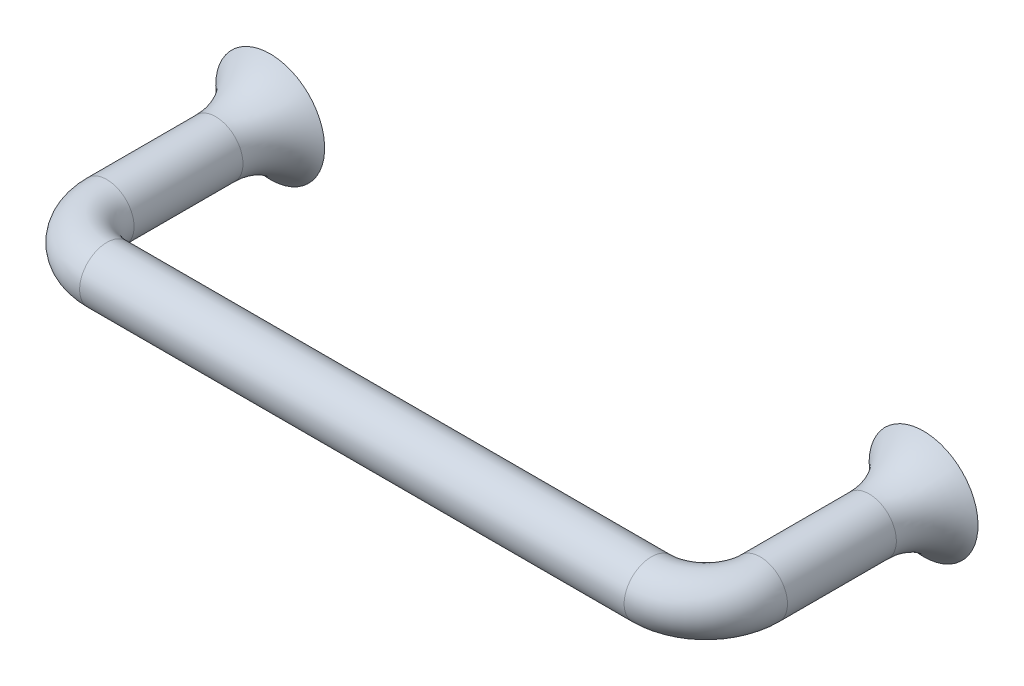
ISO-10303-21;
HEADER;
FILE_DESCRIPTION(('STEP AP214'),'2;1');
FILE_NAME('part.step','',(''),(''),'','','');
FILE_SCHEMA(('AUTOMOTIVE_DESIGN { 1 0 10303 214 1 1 1 1 }'));
ENDSEC;
DATA;
#1=APPLICATION_CONTEXT('core data for automotive mechanical design processes');
#2=APPLICATION_PROTOCOL_DEFINITION('international standard','automotive_design',2000,#1);
#3=PRODUCT_CONTEXT('',#1,'mechanical');
#4=PRODUCT('Part','Part','',(#3));
#5=PRODUCT_RELATED_PRODUCT_CATEGORY('part','',(#4));
#6=PRODUCT_DEFINITION_FORMATION('','',#4);
#7=PRODUCT_DEFINITION_CONTEXT('part definition',#1,'design');
#8=PRODUCT_DEFINITION('design','',#6,#7);
#9=PRODUCT_DEFINITION_SHAPE('','',#8);
#10=(LENGTH_UNIT() NAMED_UNIT(*) SI_UNIT(.MILLI.,.METRE.));
#11=(NAMED_UNIT(*) PLANE_ANGLE_UNIT() SI_UNIT($,.RADIAN.));
#12=(NAMED_UNIT(*) SI_UNIT($,.STERADIAN.) SOLID_ANGLE_UNIT());
#13=UNCERTAINTY_MEASURE_WITH_UNIT(LENGTH_MEASURE(1.E-05),#10,'distance_accuracy_value','');
#14=(GEOMETRIC_REPRESENTATION_CONTEXT(3) GLOBAL_UNCERTAINTY_ASSIGNED_CONTEXT((#13)) GLOBAL_UNIT_ASSIGNED_CONTEXT((#10,
#11,#12)) REPRESENTATION_CONTEXT('',''));
#15=CARTESIAN_POINT('',(0.,0.,0.));
#16=DIRECTION('',(0.,0.,1.));
#17=DIRECTION('',(1.,0.,0.));
#18=AXIS2_PLACEMENT_3D('',#15,#16,#17);
#19=CARTESIAN_POINT('',(0.,0.,30.0000000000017));
#20=DIRECTION('',(0.,0.,-1.));
#21=DIRECTION('',(0.,-1.,0.));
#22=AXIS2_PLACEMENT_3D('',#19,#20,#21);
#23=CYLINDRICAL_SURFACE('',#22,5.);
#24=CARTESIAN_POINT('',(0.,0.,10.0000000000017));
#25=DIRECTION('',(0.,0.,1.));
#26=DIRECTION('',(1.,0.,0.));
#27=AXIS2_PLACEMENT_3D('',#24,#25,#26);
#28=CIRCLE('',#27,5.);
#29=CARTESIAN_POINT('',(4.99999999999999,0.,10.0000000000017));
#30=VERTEX_POINT('',#29);
#31=EDGE_CURVE('E32',#30,#30,#28,.F.);
#32=ORIENTED_EDGE('',*,*,#31,.F.);
#33=EDGE_LOOP('',(#32));
#34=FACE_BOUND('',#33,.T.);
#35=CARTESIAN_POINT('',(0.,0.,30.0000000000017));
#36=DIRECTION('',(0.,0.,-1.));
#37=DIRECTION('',(0.,1.,0.));
#38=AXIS2_PLACEMENT_3D('',#35,#36,#37);
#39=CIRCLE('',#38,5.);
#40=CARTESIAN_POINT('',(-5.,0.,30.0000000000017));
#41=VERTEX_POINT('',#40);
#42=EDGE_CURVE('E35',#41,#41,#39,.T.);
#43=ORIENTED_EDGE('',*,*,#42,.T.);
#44=EDGE_LOOP('',(#43));
#45=FACE_BOUND('',#44,.T.);
#46=ADVANCED_FACE('F12',(#34,#45),#23,.T.);
#47=CARTESIAN_POINT('',(10.,0.,30.0000000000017));
#48=DIRECTION('',(0.,-1.,0.));
#49=DIRECTION('',(1.,0.,0.));
#50=AXIS2_PLACEMENT_3D('',#47,#48,#49);
#51=TOROIDAL_SURFACE('',#50,10.,5.);
#52=CARTESIAN_POINT('',(10.,0.,40.0000000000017));
#53=DIRECTION('',(-1.,0.,0.));
#54=DIRECTION('',(0.,1.,0.));
#55=AXIS2_PLACEMENT_3D('',#52,#53,#54);
#56=CIRCLE('',#55,5.);
#57=CARTESIAN_POINT('',(10.,0.,45.0000000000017));
#58=VERTEX_POINT('',#57);
#59=EDGE_CURVE('E38',#58,#58,#56,.T.);
#60=CARTESIAN_POINT('',(10.,0.,30.0000000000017));
#61=DIRECTION('',(0.,-1.,0.));
#62=DIRECTION('',(1.,0.,0.));
#63=AXIS2_PLACEMENT_3D('',#60,#61,#62);
#64=CIRCLE('',#63,15.);
#65=EDGE_CURVE('',#58,#41,#64,.T.);
#66=ORIENTED_EDGE('',*,*,#59,.T.);
#67=ORIENTED_EDGE('',*,*,#42,.F.);
#68=ORIENTED_EDGE('',*,*,#65,.T.);
#69=ORIENTED_EDGE('',*,*,#65,.F.);
#70=EDGE_LOOP('',(#66,#68,#67,#69));
#71=FACE_BOUND('',#70,.T.);
#72=ADVANCED_FACE('F81',(#71),#51,.T.);
#73=CARTESIAN_POINT('',(110.,0.,40.0000000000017));
#74=DIRECTION('',(-1.,0.,0.));
#75=DIRECTION('',(0.,-1.,0.));
#76=AXIS2_PLACEMENT_3D('',#73,#74,#75);
#77=CYLINDRICAL_SURFACE('',#76,5.);
#78=CARTESIAN_POINT('',(110.,0.,40.0000000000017));
#79=DIRECTION('',(-1.,0.,0.));
#80=DIRECTION('',(0.,1.,0.));
#81=AXIS2_PLACEMENT_3D('',#78,#79,#80);
#82=CIRCLE('',#81,5.);
#83=CARTESIAN_POINT('',(110.,0.,45.0000000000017));
#84=VERTEX_POINT('',#83);
#85=EDGE_CURVE('E41',#84,#84,#82,.T.);
#86=ORIENTED_EDGE('',*,*,#85,.T.);
#87=EDGE_LOOP('',(#86));
#88=FACE_BOUND('',#87,.T.);
#89=ORIENTED_EDGE('',*,*,#59,.F.);
#90=EDGE_LOOP('',(#89));
#91=FACE_BOUND('',#90,.T.);
#92=ADVANCED_FACE('F88',(#88,#91),#77,.T.);
#93=CARTESIAN_POINT('',(110.,0.,30.0000000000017));
#94=DIRECTION('',(0.,-1.,0.));
#95=DIRECTION('',(1.,0.,0.));
#96=AXIS2_PLACEMENT_3D('',#93,#94,#95);
#97=TOROIDAL_SURFACE('',#96,10.,5.);
#98=CARTESIAN_POINT('',(120.,0.,30.0000000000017));
#99=DIRECTION('',(0.,0.,1.));
#100=DIRECTION('',(0.,1.,0.));
#101=AXIS2_PLACEMENT_3D('',#98,#99,#100);
#102=CIRCLE('',#101,5.);
#103=CARTESIAN_POINT('',(125.,0.,30.0000000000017));
#104=VERTEX_POINT('',#103);
#105=EDGE_CURVE('E44',#104,#104,#102,.T.);
#106=CARTESIAN_POINT('',(110.,0.,30.0000000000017));
#107=DIRECTION('',(0.,-1.,0.));
#108=DIRECTION('',(1.,0.,0.));
#109=AXIS2_PLACEMENT_3D('',#106,#107,#108);
#110=CIRCLE('',#109,15.);
#111=EDGE_CURVE('',#104,#84,#110,.T.);
#112=ORIENTED_EDGE('',*,*,#105,.T.);
#113=ORIENTED_EDGE('',*,*,#85,.F.);
#114=ORIENTED_EDGE('',*,*,#111,.T.);
#115=ORIENTED_EDGE('',*,*,#111,.F.);
#116=EDGE_LOOP('',(#112,#114,#113,#115));
#117=FACE_BOUND('',#116,.T.);
#118=ADVANCED_FACE('F131',(#117),#97,.T.);
#119=CARTESIAN_POINT('',(120.,0.,30.0000000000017));
#120=DIRECTION('',(0.,0.,-1.));
#121=DIRECTION('',(0.,-1.,0.));
#122=AXIS2_PLACEMENT_3D('',#119,#120,#121);
#123=CYLINDRICAL_SURFACE('',#122,5.);
#124=CARTESIAN_POINT('',(120.,0.,10.0000000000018));
#125=DIRECTION('',(0.,0.,-1.));
#126=DIRECTION('',(0.,-1.,0.));
#127=AXIS2_PLACEMENT_3D('',#124,#125,#126);
#128=CIRCLE('',#127,5.);
#129=CARTESIAN_POINT('',(120.,-5.,10.0000000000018));
#130=VERTEX_POINT('',#129);
#131=EDGE_CURVE('E47',#130,#130,#128,.T.);
#132=ORIENTED_EDGE('',*,*,#131,.F.);
#133=EDGE_LOOP('',(#132));
#134=FACE_BOUND('',#133,.T.);
#135=ORIENTED_EDGE('',*,*,#105,.F.);
#136=EDGE_LOOP('',(#135));
#137=FACE_BOUND('',#136,.T.);
#138=ADVANCED_FACE('F124',(#134,#137),#123,.T.);
#139=CARTESIAN_POINT('',(120.,0.,10.0000000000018));
#140=DIRECTION('',(0.,0.,-1.));
#141=DIRECTION('',(0.,-1.,0.));
#142=AXIS2_PLACEMENT_3D('',#139,#140,#141);
#143=TOROIDAL_SURFACE('',#142,17.5,12.5);
#144=ORIENTED_EDGE('',*,*,#131,.T.);
#145=EDGE_LOOP('',(#144));
#146=FACE_BOUND('',#145,.T.);
#147=CARTESIAN_POINT('',(120.,0.,1.7654356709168E-12));
#148=DIRECTION('',(0.,0.,-1.));
#149=DIRECTION('',(0.,-1.,0.));
#150=AXIS2_PLACEMENT_3D('',#147,#148,#149);
#151=CIRCLE('',#150,10.);
#152=CARTESIAN_POINT('',(120.,-10.,1.7654356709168E-12));
#153=VERTEX_POINT('',#152);
#154=EDGE_CURVE('E50',#153,#153,#151,.T.);
#155=ORIENTED_EDGE('',*,*,#154,.F.);
#156=EDGE_LOOP('',(#155));
#157=FACE_BOUND('',#156,.T.);
#158=ADVANCED_FACE('F121',(#146,#157),#143,.F.);
#159=CARTESIAN_POINT('',(120.,0.,1.76456830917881E-12));
#160=DIRECTION('',(0.,0.,1.));
#161=DIRECTION('',(0.,1.,0.));
#162=AXIS2_PLACEMENT_3D('',#159,#160,#161);
#163=PLANE('',#162);
#164=CARTESIAN_POINT('',(120.,0.,1.76456830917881E-12));
#165=DIRECTION('',(0.,0.,1.));
#166=DIRECTION('',(1.,0.,0.));
#167=AXIS2_PLACEMENT_3D('',#164,#165,#166);
#168=CIRCLE('',#167,2.95);
#169=CARTESIAN_POINT('',(122.95,0.,1.76456830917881E-12));
#170=VERTEX_POINT('',#169);
#171=EDGE_CURVE('E23',#170,#170,#168,.T.);
#172=ORIENTED_EDGE('',*,*,#171,.T.);
#173=EDGE_LOOP('',(#172));
#174=FACE_BOUND('',#173,.T.);
#175=ORIENTED_EDGE('',*,*,#154,.T.);
#176=EDGE_LOOP('',(#175));
#177=FACE_BOUND('',#176,.T.);
#178=ADVANCED_FACE('F119',(#174,#177),#163,.F.);
#179=CARTESIAN_POINT('',(0.,0.,10.0000000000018));
#180=DIRECTION('',(0.,0.,-1.));
#181=DIRECTION('',(-1.,0.,0.));
#182=AXIS2_PLACEMENT_3D('',#179,#180,#181);
#183=TOROIDAL_SURFACE('',#182,17.5,12.5);
#184=ORIENTED_EDGE('',*,*,#31,.T.);
#185=EDGE_LOOP('',(#184));
#186=FACE_BOUND('',#185,.T.);
#187=CARTESIAN_POINT('',(0.,0.,1.74895514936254E-12));
#188=DIRECTION('',(0.,0.,-1.));
#189=DIRECTION('',(-1.,0.,0.));
#190=AXIS2_PLACEMENT_3D('',#187,#188,#189);
#191=CIRCLE('',#190,10.);
#192=CARTESIAN_POINT('',(-10.,0.,1.76283293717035E-12));
#193=VERTEX_POINT('',#192);
#194=EDGE_CURVE('E53',#193,#193,#191,.T.);
#195=ORIENTED_EDGE('',*,*,#194,.F.);
#196=EDGE_LOOP('',(#195));
#197=FACE_BOUND('',#196,.T.);
#198=ADVANCED_FACE('F114',(#186,#197),#183,.F.);
#199=CARTESIAN_POINT('',(0.,0.,1.77497665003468E-12));
#200=DIRECTION('',(0.,0.,-1.));
#201=DIRECTION('',(0.,1.,0.));
#202=AXIS2_PLACEMENT_3D('',#199,#200,#201);
#203=PLANE('',#202);
#204=CARTESIAN_POINT('',(0.,0.,1.77497665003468E-12));
#205=DIRECTION('',(0.,0.,-1.));
#206=DIRECTION('',(-1.,0.,0.));
#207=AXIS2_PLACEMENT_3D('',#204,#205,#206);
#208=CIRCLE('',#207,2.94999999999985);
#209=CARTESIAN_POINT('',(-2.94999999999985,0.,1.68821870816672E-12));
#210=VERTEX_POINT('',#209);
#211=EDGE_CURVE('E8',#210,#210,#208,.F.);
#212=ORIENTED_EDGE('',*,*,#211,.T.);
#213=EDGE_LOOP('',(#212));
#214=FACE_BOUND('',#213,.T.);
#215=ORIENTED_EDGE('',*,*,#194,.T.);
#216=EDGE_LOOP('',(#215));
#217=FACE_BOUND('',#216,.T.);
#218=ADVANCED_FACE('F107',(#214,#217),#203,.T.);
#219=CARTESIAN_POINT('',(120.,0.,10.0000000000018));
#220=DIRECTION('',(0.,0.,-1.));
#221=DIRECTION('',(0.,-1.,0.));
#222=AXIS2_PLACEMENT_3D('',#219,#220,#221);
#223=CYLINDRICAL_SURFACE('',#222,2.5);
#224=CARTESIAN_POINT('',(120.,0.,0.450000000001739));
#225=DIRECTION('',(0.,0.,1.));
#226=DIRECTION('',(1.,0.,0.));
#227=AXIS2_PLACEMENT_3D('',#224,#225,#226);
#228=CIRCLE('',#227,2.5);
#229=CARTESIAN_POINT('',(122.5,0.,0.450000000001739));
#230=VERTEX_POINT('',#229);
#231=EDGE_CURVE('E27',#230,#230,#228,.F.);
#232=ORIENTED_EDGE('',*,*,#231,.T.);
#233=EDGE_LOOP('',(#232));
#234=FACE_BOUND('',#233,.T.);
#235=CARTESIAN_POINT('',(120.,0.,10.0000000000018));
#236=DIRECTION('',(0.,0.,-1.));
#237=DIRECTION('',(0.,-1.,0.));
#238=AXIS2_PLACEMENT_3D('',#235,#236,#237);
#239=CIRCLE('',#238,2.5);
#240=CARTESIAN_POINT('',(120.,-2.5,10.0000000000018));
#241=VERTEX_POINT('',#240);
#242=EDGE_CURVE('E56',#241,#241,#239,.T.);
#243=ORIENTED_EDGE('',*,*,#242,.F.);
#244=EDGE_LOOP('',(#243));
#245=FACE_BOUND('',#244,.T.);
#246=ADVANCED_FACE('F77',(#234,#245),#223,.F.);
#247=CARTESIAN_POINT('',(120.,0.,10.0000000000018));
#248=DIRECTION('',(0.,0.,-1.));
#249=DIRECTION('',(0.,-1.,0.));
#250=AXIS2_PLACEMENT_3D('',#247,#248,#249);
#251=PLANE('',#250);
#252=ORIENTED_EDGE('',*,*,#242,.T.);
#253=EDGE_LOOP('',(#252));
#254=FACE_BOUND('',#253,.T.);
#255=ADVANCED_FACE('F67',(#254),#251,.T.);
#256=CARTESIAN_POINT('',(0.,0.,10.0000000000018));
#257=DIRECTION('',(0.,0.,-1.));
#258=DIRECTION('',(0.,-1.,0.));
#259=AXIS2_PLACEMENT_3D('',#256,#257,#258);
#260=CYLINDRICAL_SURFACE('',#259,2.5);
#261=CARTESIAN_POINT('',(0.,0.,0.450000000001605));
#262=DIRECTION('',(0.,0.,-1.));
#263=DIRECTION('',(-1.,0.,0.));
#264=AXIS2_PLACEMENT_3D('',#261,#262,#263);
#265=CIRCLE('',#264,2.5);
#266=CARTESIAN_POINT('',(-2.5,0.,0.450000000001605));
#267=VERTEX_POINT('',#266);
#268=EDGE_CURVE('E19',#267,#267,#265,.T.);
#269=ORIENTED_EDGE('',*,*,#268,.T.);
#270=EDGE_LOOP('',(#269));
#271=FACE_BOUND('',#270,.T.);
#272=CARTESIAN_POINT('',(0.,0.,10.0000000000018));
#273=DIRECTION('',(0.,0.,-1.));
#274=DIRECTION('',(0.,-1.,0.));
#275=AXIS2_PLACEMENT_3D('',#272,#273,#274);
#276=CIRCLE('',#275,2.5);
#277=CARTESIAN_POINT('',(0.,-2.5,10.0000000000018));
#278=VERTEX_POINT('',#277);
#279=EDGE_CURVE('E59',#278,#278,#276,.T.);
#280=ORIENTED_EDGE('',*,*,#279,.F.);
#281=EDGE_LOOP('',(#280));
#282=FACE_BOUND('',#281,.T.);
#283=ADVANCED_FACE('F65',(#271,#282),#260,.F.);
#284=CARTESIAN_POINT('',(0.,0.,10.0000000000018));
#285=DIRECTION('',(0.,0.,-1.));
#286=DIRECTION('',(0.,-1.,0.));
#287=AXIS2_PLACEMENT_3D('',#284,#285,#286);
#288=PLANE('',#287);
#289=ORIENTED_EDGE('',*,*,#279,.T.);
#290=EDGE_LOOP('',(#289));
#291=FACE_BOUND('',#290,.T.);
#292=ADVANCED_FACE('F63',(#291),#288,.T.);
#293=CARTESIAN_POINT('',(120.,0.,0.450000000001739));
#294=DIRECTION('',(0.,0.,-1.));
#295=DIRECTION('',(-1.,0.,0.));
#296=AXIS2_PLACEMENT_3D('',#293,#294,#295);
#297=CONICAL_SURFACE('',#296,2.5,0.785398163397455);
#298=ORIENTED_EDGE('',*,*,#171,.F.);
#299=EDGE_LOOP('',(#298));
#300=FACE_BOUND('',#299,.T.);
#301=ORIENTED_EDGE('',*,*,#231,.F.);
#302=EDGE_LOOP('',(#301));
#303=FACE_BOUND('',#302,.T.);
#304=ADVANCED_FACE('F75',(#300,#303),#297,.F.);
#305=CARTESIAN_POINT('',(0.,0.,0.450000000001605));
#306=DIRECTION('',(0.,0.,-1.));
#307=DIRECTION('',(-1.,0.,0.));
#308=AXIS2_PLACEMENT_3D('',#305,#306,#307);
#309=CONICAL_SURFACE('',#308,2.5,0.785398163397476);
#310=ORIENTED_EDGE('',*,*,#211,.F.);
#311=EDGE_LOOP('',(#310));
#312=FACE_BOUND('',#311,.T.);
#313=ORIENTED_EDGE('',*,*,#268,.F.);
#314=EDGE_LOOP('',(#313));
#315=FACE_BOUND('',#314,.T.);
#316=ADVANCED_FACE('F14',(#312,#315),#309,.F.);
#317=CLOSED_SHELL('',(#46,#72,#92,#118,#138,#158,#178,#198,#218,#246,#255,#283,#292,#304,#316));
#318=MANIFOLD_SOLID_BREP('B1',#317);
#319=ADVANCED_BREP_SHAPE_REPRESENTATION('',(#18,#318),#14);
#320=SHAPE_DEFINITION_REPRESENTATION(#9,#319);
ENDSEC;
END-ISO-10303-21;
